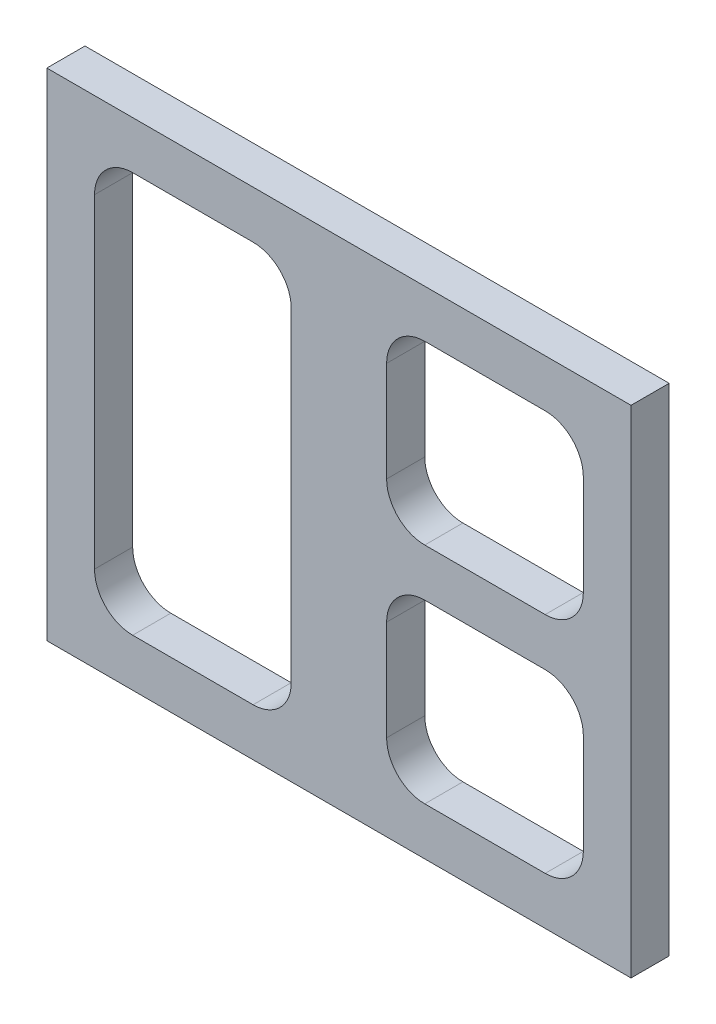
from build123d import *

# Parameters (mm, degrees)
SKETCH_1_W      = 245
SKETCH_1_H      = 208
EXTRUDE_1_DEPTH = 16


with BuildPart() as part:
    # Sketch 1 → Extrude 1 (new body)
    with BuildSketch(Plane.XY):
        Rectangle(SKETCH_1_W, SKETCH_1_H)
        with BuildLine():
            Line((-102.5, 68), (-102.5, -68))
            ThreePointArc((-102.5, -68), (-97.813708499, -79.313708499), (-86.5, -84))
            Line((-86.5, -84), (-36, -84))
            ThreePointArc((-36, -84), (-24.686291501, -79.313708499), (-20, -68))
            Line((-20, -68), (-20, 68))
            ThreePointArc((-20, 68), (-24.686291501, 79.313708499), (-36, 84))
            Line((-36, 84), (-86.5, 84))
            ThreePointArc((-86.5, 84), (-97.813708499, 79.313708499), (-102.5, 68))
        make_face(mode=Mode.SUBTRACT)
        with BuildLine():
            Line((102.5, 68), (102.5, 26))
            ThreePointArc((102.5, 26), (97.813708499, 14.686291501), (86.5, 10))
            Line((86.5, 10), (36, 10))
            ThreePointArc((36, 10), (24.686291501, 14.686291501), (20, 26))
            Line((20, 26), (20, 68))
            ThreePointArc((20, 68), (24.686291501, 79.313708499), (36, 84))
            Line((36, 84), (86.5, 84))
            ThreePointArc((86.5, 84), (97.813708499, 79.313708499), (102.5, 68))
        make_face(mode=Mode.SUBTRACT)
        with BuildLine():
            Line((36, -84), (86.5, -84))
            ThreePointArc((86.5, -84), (97.813708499, -79.313708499), (102.5, -68))
            Line((102.5, -68), (102.5, -26))
            ThreePointArc((102.5, -26), (97.813708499, -14.686291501), (86.5, -10))
            Line((86.5, -10), (36, -10))
            ThreePointArc((36, -10), (24.686291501, -14.686291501), (20, -26))
            Line((20, -26), (20, -68))
            ThreePointArc((20, -68), (24.686291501, -79.313708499), (36, -84))
        make_face(mode=Mode.SUBTRACT)
    extrude(amount=EXTRUDE_1_DEPTH)


solid = part.part
